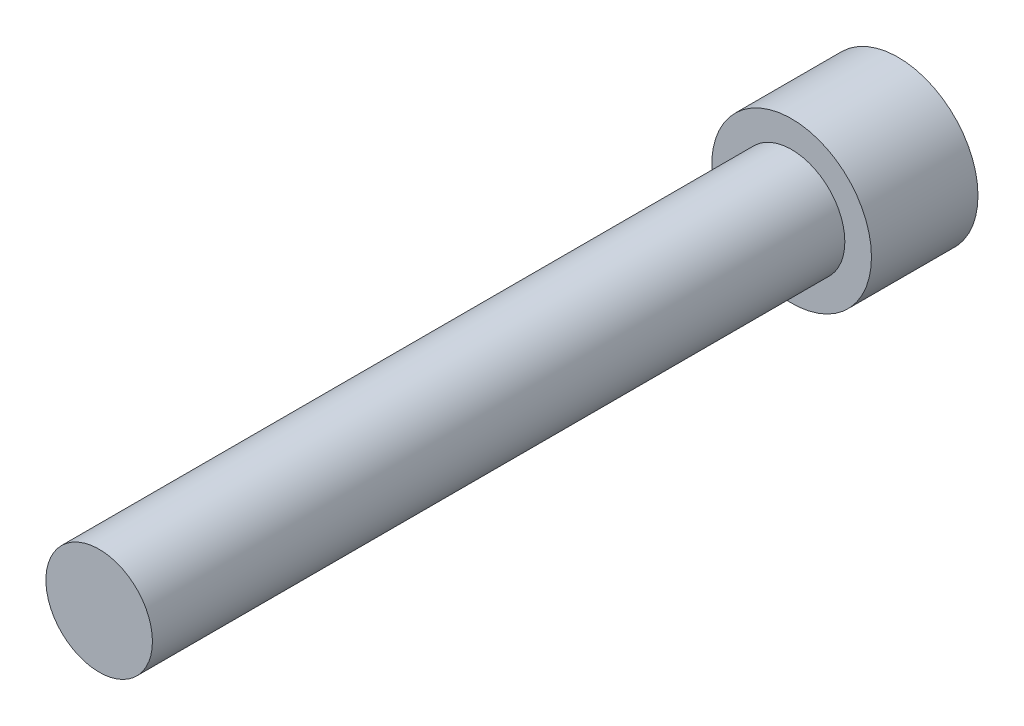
from build123d import *

# Parameters (mm, degrees)
HEX_2_DEPTH = 3.556


with BuildPart() as part:
    # Sketch6 → Revolve1 (revolve)
    with BuildSketch(Plane(origin=(0, 0, 0), x_dir=(0, 0, -1), z_dir=(1, 0, 0)), mode=Mode.PRIVATE) as revolve1_sk:
        Polygon((-41.275, 0), (-41.275, -3.175), (0, -3.175), (0, -4.7625), (6.35, -4.7625), (6.35, 0), align=None)
    revolve(revolve1_sk.sketch.rotate(Axis((0, 0, 41.275), (0, 0, -1)), 270), axis=Axis((0, 0, 41.275), (0, 0, -1)))

    # Sketch7 → HEX 2 (cut)
    with BuildSketch(Plane(origin=(0, 0, -6.35), x_dir=(-1, 0, 0), z_dir=(0, 0, -1))):
        Polygon((-2.3876, 1.378481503), (-2.3876, -1.378481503), (0, -2.756963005), (2.3876, -1.378481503), (2.3876, 1.378481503), (0, 2.756963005), align=None)
    extrude(amount=-HEX_2_DEPTH, mode=Mode.SUBTRACT)


solid = part.part
